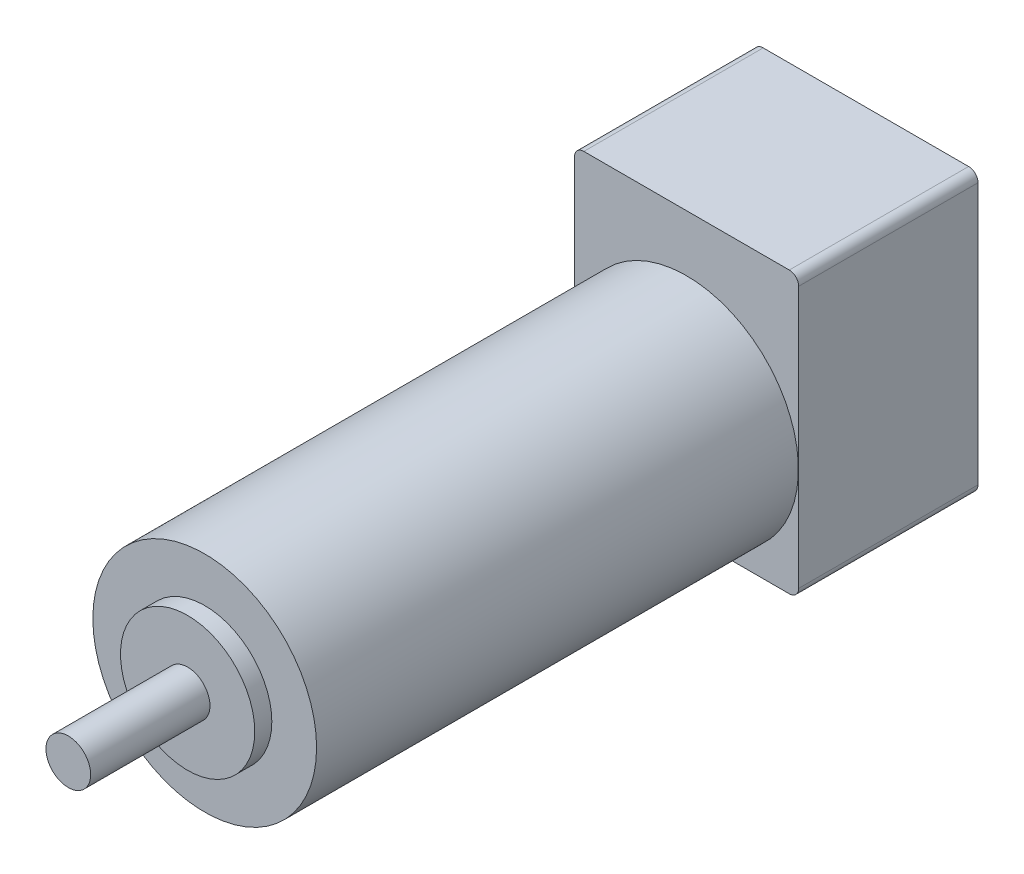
from build123d import *

# Parameters (mm, degrees)
SKETCH1_R      = 30.2514
EXTRUDE1_DEPTH = 130.2766
SKETCH2_W      = 60.6298
SKETCH2_H      = 75.819
EXTRUDE2_DEPTH = 48.4886
SKETCH3_R      = 18.1483
EXTRUDE3_DEPTH = 4.6228
SKETCH4_R      = 6.0452
EXTRUDE4_DEPTH = 32.258
FILLET1_R      = 2.54
FILLET2_R      = 2.54
FILLET3_R      = 2.54
FILLET4_R      = 2.54


with BuildPart() as part:
    # Sketch1 → Extrude1 (new body)
    with BuildSketch(Plane.XY):
        Circle(SKETCH1_R)
    extrude(amount=EXTRUDE1_DEPTH)

    # Sketch2 → Extrude2 (add)
    with BuildSketch(Plane(origin=(0, 0, 0), x_dir=(-1, 0, 0), z_dir=(0, 0, -1))):
        with Locations((-0.0127, 7.5565)):
            Rectangle(SKETCH2_W, SKETCH2_H)
    extrude(amount=EXTRUDE2_DEPTH)

    # Sketch3 → Extrude3 (add)
    with BuildSketch(Plane.XY.offset(130.2766)):
        Circle(SKETCH3_R)
    extrude(amount=EXTRUDE3_DEPTH)

    # Sketch4 → Extrude4 (add)
    with BuildSketch(Plane.XY.offset(134.8994)):
        Circle(SKETCH4_R)
    extrude(amount=EXTRUDE4_DEPTH)

    # Fillet1
    fillet1_edges = [part.edges().sort_by_distance(p)[0] for p in [
        (30.3276, -30.353, -24.2443),
    ]]
    fillet(fillet1_edges, radius=FILLET1_R)

    # Fillet2
    fillet2_edges = [part.edges().sort_by_distance(p)[0] for p in [
        (30.3276, 45.466, -24.2443),
    ]]
    fillet(fillet2_edges, radius=FILLET2_R)

    # Fillet3
    fillet3_edges = [part.edges().sort_by_distance(p)[0] for p in [
        (-30.3022, 45.466, -24.2443),
    ]]
    fillet(fillet3_edges, radius=FILLET3_R)

    # Fillet4
    fillet4_edges = [part.edges().sort_by_distance(p)[0] for p in [
        (-30.3022, -30.353, -24.2443),
    ]]
    fillet(fillet4_edges, radius=FILLET4_R)


solid = part.part
